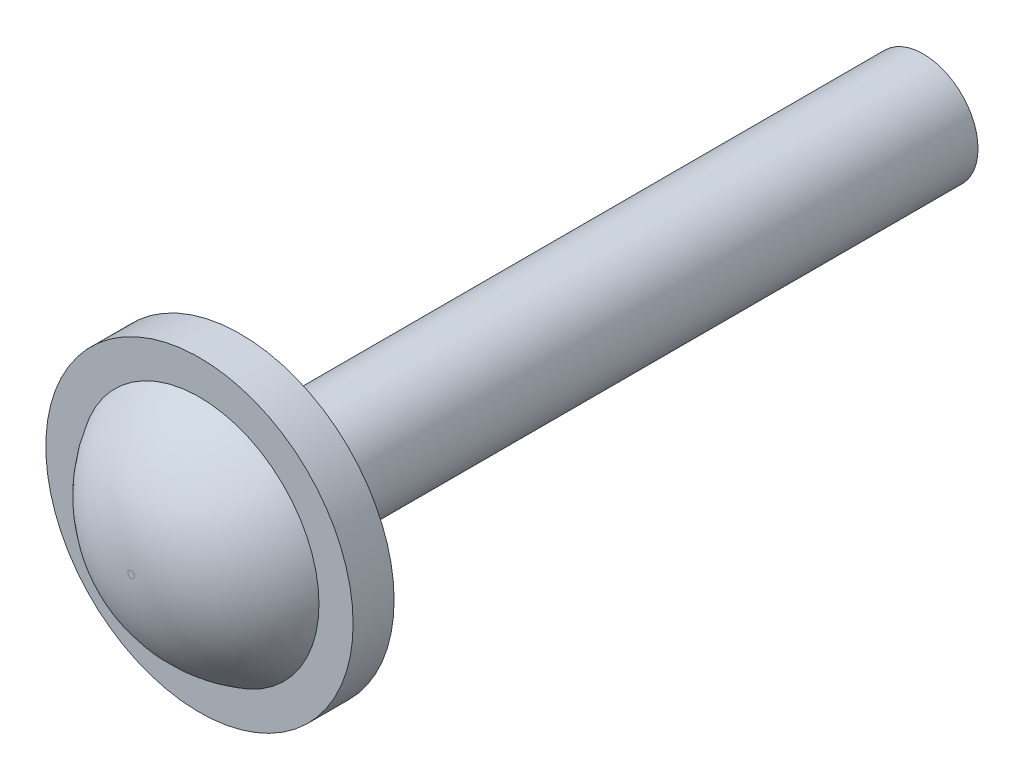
from build123d import *


with BuildPart() as part:
    # Skizze1 → Basis-Rotation (revolve)
    with BuildSketch(Plane(origin=(0, 0, 0), x_dir=(0, 0, -1), z_dir=(1, 0, 0)), mode=Mode.PRIVATE) as basis_rotation_sk:
        with BuildLine():
            Line((10, 0), (10, 0.8))
            Line((10, 0.8), (5, 0.8))
            Line((5, 0.8), (3, 0.8))
            Line((3, 0.8), (1, 0.8))
            ThreePointArc((1, 0.8), (0.292893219, 1.092893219), (0, 1.8))
            Line((0, 1.8), (0, 2.25))
            Line((0, 2.25), (-0.6, 2.25))
            Line((-0.6, 2.25), (-0.6, 1.75))
            ThreePointArc((-0.6, 1.75), (-1.331462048, 1.036154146), (-1.6, 0.05))
            Line((-1.6, 0.05), (-1.6, 0))
            Line((-1.6, 0), (10, 0))
        make_face()
    revolve(basis_rotation_sk.sketch.rotate(Axis((0, 0, 0), (0, 0, -1)), 90), axis=Axis((0, 0, 0), (0, 0, -1)))


solid = part.part
